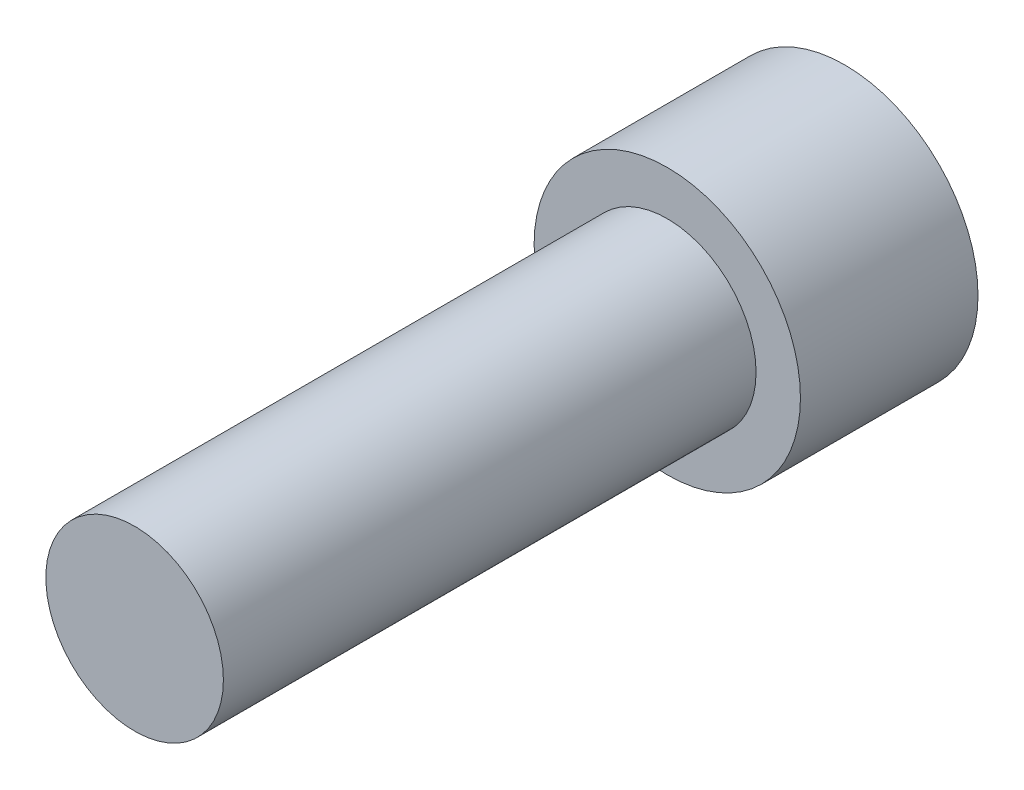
ISO-10303-21;
HEADER;
FILE_DESCRIPTION(('STEP AP214'),'2;1');
FILE_NAME('part.step','',(''),(''),'','','');
FILE_SCHEMA(('AUTOMOTIVE_DESIGN { 1 0 10303 214 1 1 1 1 }'));
ENDSEC;
DATA;
#1=APPLICATION_CONTEXT('core data for automotive mechanical design processes');
#2=APPLICATION_PROTOCOL_DEFINITION('international standard','automotive_design',2000,#1);
#3=PRODUCT_CONTEXT('',#1,'mechanical');
#4=PRODUCT('Part','Part','',(#3));
#5=PRODUCT_RELATED_PRODUCT_CATEGORY('part','',(#4));
#6=PRODUCT_DEFINITION_FORMATION('','',#4);
#7=PRODUCT_DEFINITION_CONTEXT('part definition',#1,'design');
#8=PRODUCT_DEFINITION('design','',#6,#7);
#9=PRODUCT_DEFINITION_SHAPE('','',#8);
#10=(LENGTH_UNIT() NAMED_UNIT(*) SI_UNIT(.MILLI.,.METRE.));
#11=(NAMED_UNIT(*) PLANE_ANGLE_UNIT() SI_UNIT($,.RADIAN.));
#12=(NAMED_UNIT(*) SI_UNIT($,.STERADIAN.) SOLID_ANGLE_UNIT());
#13=UNCERTAINTY_MEASURE_WITH_UNIT(LENGTH_MEASURE(1.E-05),#10,'distance_accuracy_value','');
#14=(GEOMETRIC_REPRESENTATION_CONTEXT(3) GLOBAL_UNCERTAINTY_ASSIGNED_CONTEXT((#13)) GLOBAL_UNIT_ASSIGNED_CONTEXT((#10,
#11,#12)) REPRESENTATION_CONTEXT('',''));
#15=CARTESIAN_POINT('',(0.,0.,0.));
#16=DIRECTION('',(0.,0.,1.));
#17=DIRECTION('',(1.,0.,0.));
#18=AXIS2_PLACEMENT_3D('',#15,#16,#17);
#19=CARTESIAN_POINT('',(0.,-9.525,-12.7));
#20=DIRECTION('',(0.,0.,-1.));
#21=DIRECTION('',(-1.,0.,0.));
#22=AXIS2_PLACEMENT_3D('',#19,#20,#21);
#23=PLANE('',#22);
#24=DIRECTION('',(0.866025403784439,-0.5,0.));
#25=VECTOR('',#24,1.);
#26=CARTESIAN_POINT('',(0.,5.49926131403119,-12.7));
#27=LINE('',#26,#25);
#28=CARTESIAN_POINT('',(0.,5.49926131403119,-12.7));
#29=VERTEX_POINT('',#28);
#30=CARTESIAN_POINT('',(4.7625,2.74963065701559,-12.7));
#31=VERTEX_POINT('',#30);
#32=EDGE_CURVE('E46',#29,#31,#27,.T.);
#33=ORIENTED_EDGE('',*,*,#32,.F.);
#34=DIRECTION('',(0.866025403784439,0.5,0.));
#35=VECTOR('',#34,1.);
#36=CARTESIAN_POINT('',(-4.7625,2.74963065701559,-12.7));
#37=LINE('',#36,#35);
#38=CARTESIAN_POINT('',(-4.7625,2.74963065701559,-12.7));
#39=VERTEX_POINT('',#38);
#40=EDGE_CURVE('E129',#39,#29,#37,.T.);
#41=ORIENTED_EDGE('',*,*,#40,.F.);
#42=DIRECTION('',(0.,1.,0.));
#43=VECTOR('',#42,1.);
#44=CARTESIAN_POINT('',(-4.7625,-2.74963065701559,-12.7));
#45=LINE('',#44,#43);
#46=CARTESIAN_POINT('',(-4.7625,-2.74963065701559,-12.7));
#47=VERTEX_POINT('',#46);
#48=EDGE_CURVE('E127',#47,#39,#45,.T.);
#49=ORIENTED_EDGE('',*,*,#48,.F.);
#50=DIRECTION('',(-0.866025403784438,0.5,0.));
#51=VECTOR('',#50,1.);
#52=CARTESIAN_POINT('',(0.,-5.49926131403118,-12.7));
#53=LINE('',#52,#51);
#54=CARTESIAN_POINT('',(0.,-5.49926131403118,-12.7));
#55=VERTEX_POINT('',#54);
#56=EDGE_CURVE('E94',#55,#47,#53,.T.);
#57=ORIENTED_EDGE('',*,*,#56,.F.);
#58=DIRECTION('',(-0.866025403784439,-0.5,0.));
#59=VECTOR('',#58,1.);
#60=CARTESIAN_POINT('',(4.7625,-2.74963065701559,-12.7));
#61=LINE('',#60,#59);
#62=CARTESIAN_POINT('',(4.7625,-2.74963065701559,-12.7));
#63=VERTEX_POINT('',#62);
#64=EDGE_CURVE('E123',#63,#55,#61,.T.);
#65=ORIENTED_EDGE('',*,*,#64,.F.);
#66=DIRECTION('',(0.,-1.,0.));
#67=VECTOR('',#66,1.);
#68=CARTESIAN_POINT('',(4.7625,2.74963065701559,-12.7));
#69=LINE('',#68,#67);
#70=EDGE_CURVE('E120',#31,#63,#69,.T.);
#71=ORIENTED_EDGE('',*,*,#70,.F.);
#72=EDGE_LOOP('',(#33,#41,#49,#57,#65,#71));
#73=FACE_BOUND('',#72,.T.);
#74=CARTESIAN_POINT('',(0.,0.,-12.7));
#75=DIRECTION('',(0.,0.,1.));
#76=DIRECTION('',(1.,0.,0.));
#77=AXIS2_PLACEMENT_3D('',#74,#75,#76);
#78=CIRCLE('',#77,9.525);
#79=CARTESIAN_POINT('',(9.525,0.,-12.7));
#80=VERTEX_POINT('',#79);
#81=EDGE_CURVE('E11',#80,#80,#78,.T.);
#82=ORIENTED_EDGE('',*,*,#81,.F.);
#83=EDGE_LOOP('',(#82));
#84=FACE_BOUND('',#83,.T.);
#85=ADVANCED_FACE('F32',(#73,#84),#23,.T.);
#86=CARTESIAN_POINT('',(0.,0.,38.1));
#87=DIRECTION('',(0.,0.,1.));
#88=DIRECTION('',(1.,0.,0.));
#89=AXIS2_PLACEMENT_3D('',#86,#87,#88);
#90=CYLINDRICAL_SURFACE('',#89,9.525);
#91=ORIENTED_EDGE('',*,*,#81,.T.);
#92=EDGE_LOOP('',(#91));
#93=FACE_BOUND('',#92,.T.);
#94=CARTESIAN_POINT('',(0.,0.,0.));
#95=DIRECTION('',(0.,0.,1.));
#96=DIRECTION('',(1.,0.,0.));
#97=AXIS2_PLACEMENT_3D('',#94,#95,#96);
#98=CIRCLE('',#97,9.525);
#99=CARTESIAN_POINT('',(9.525,0.,0.));
#100=VERTEX_POINT('',#99);
#101=EDGE_CURVE('E39',#100,#100,#98,.T.);
#102=ORIENTED_EDGE('',*,*,#101,.F.);
#103=EDGE_LOOP('',(#102));
#104=FACE_BOUND('',#103,.T.);
#105=ADVANCED_FACE('F149',(#93,#104),#90,.T.);
#106=CARTESIAN_POINT('',(0.,-6.35,0.));
#107=DIRECTION('',(0.,0.,1.));
#108=DIRECTION('',(1.,0.,0.));
#109=AXIS2_PLACEMENT_3D('',#106,#107,#108);
#110=PLANE('',#109);
#111=ORIENTED_EDGE('',*,*,#101,.T.);
#112=EDGE_LOOP('',(#111));
#113=FACE_BOUND('',#112,.T.);
#114=CARTESIAN_POINT('',(0.,0.,0.));
#115=DIRECTION('',(0.,0.,1.));
#116=DIRECTION('',(1.,0.,0.));
#117=AXIS2_PLACEMENT_3D('',#114,#115,#116);
#118=CIRCLE('',#117,6.35);
#119=CARTESIAN_POINT('',(6.35,0.,0.));
#120=VERTEX_POINT('',#119);
#121=EDGE_CURVE('E141',#120,#120,#118,.T.);
#122=ORIENTED_EDGE('',*,*,#121,.F.);
#123=EDGE_LOOP('',(#122));
#124=FACE_BOUND('',#123,.T.);
#125=ADVANCED_FACE('F146',(#113,#124),#110,.T.);
#126=CARTESIAN_POINT('',(0.,0.,38.1));
#127=DIRECTION('',(0.,0.,1.));
#128=DIRECTION('',(1.,0.,0.));
#129=AXIS2_PLACEMENT_3D('',#126,#127,#128);
#130=CYLINDRICAL_SURFACE('',#129,6.35);
#131=ORIENTED_EDGE('',*,*,#121,.T.);
#132=EDGE_LOOP('',(#131));
#133=FACE_BOUND('',#132,.T.);
#134=CARTESIAN_POINT('',(0.,0.,38.1));
#135=DIRECTION('',(0.,0.,1.));
#136=DIRECTION('',(1.,0.,0.));
#137=AXIS2_PLACEMENT_3D('',#134,#135,#136);
#138=CIRCLE('',#137,6.35);
#139=CARTESIAN_POINT('',(6.35,0.,38.1));
#140=VERTEX_POINT('',#139);
#141=EDGE_CURVE('E133',#140,#140,#138,.T.);
#142=ORIENTED_EDGE('',*,*,#141,.F.);
#143=EDGE_LOOP('',(#142));
#144=FACE_BOUND('',#143,.T.);
#145=ADVANCED_FACE('F156',(#133,#144),#130,.T.);
#146=CARTESIAN_POINT('',(0.,0.,38.1));
#147=DIRECTION('',(0.,0.,1.));
#148=DIRECTION('',(1.,0.,0.));
#149=AXIS2_PLACEMENT_3D('',#146,#147,#148);
#150=PLANE('',#149);
#151=ORIENTED_EDGE('',*,*,#141,.T.);
#152=EDGE_LOOP('',(#151));
#153=FACE_BOUND('',#152,.T.);
#154=ADVANCED_FACE('F162',(#153),#150,.T.);
#155=CARTESIAN_POINT('',(0.,5.49926131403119,-5.588));
#156=DIRECTION('',(0.5,0.866025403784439,0.));
#157=DIRECTION('',(-0.866025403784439,0.5,0.));
#158=AXIS2_PLACEMENT_3D('',#155,#156,#157);
#159=PLANE('',#158);
#160=ORIENTED_EDGE('',*,*,#32,.T.);
#161=DIRECTION('',(0.,0.,-1.));
#162=VECTOR('',#161,1.);
#163=CARTESIAN_POINT('',(4.7625,2.74963065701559,-5.588));
#164=LINE('',#163,#162);
#165=CARTESIAN_POINT('',(4.7625,2.74963065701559,-5.588));
#166=VERTEX_POINT('',#165);
#167=EDGE_CURVE('E76',#166,#31,#164,.T.);
#168=ORIENTED_EDGE('',*,*,#167,.F.);
#169=DIRECTION('',(0.866025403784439,-0.5,0.));
#170=VECTOR('',#169,1.);
#171=CARTESIAN_POINT('',(0.,5.49926131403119,-5.588));
#172=LINE('',#171,#170);
#173=CARTESIAN_POINT('',(0.,5.49926131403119,-5.588));
#174=VERTEX_POINT('',#173);
#175=EDGE_CURVE('E131',#174,#166,#172,.T.);
#176=ORIENTED_EDGE('',*,*,#175,.F.);
#177=DIRECTION('',(0.,0.,-1.));
#178=VECTOR('',#177,1.);
#179=CARTESIAN_POINT('',(0.,5.49926131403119,-5.588));
#180=LINE('',#179,#178);
#181=EDGE_CURVE('E54',#174,#29,#180,.T.);
#182=ORIENTED_EDGE('',*,*,#181,.T.);
#183=EDGE_LOOP('',(#160,#168,#176,#182));
#184=FACE_BOUND('',#183,.T.);
#185=ADVANCED_FACE('F166',(#184),#159,.F.);
#186=CARTESIAN_POINT('',(-4.7625,2.74963065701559,-5.588));
#187=DIRECTION('',(-0.5,0.866025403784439,0.));
#188=DIRECTION('',(-0.866025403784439,-0.5,0.));
#189=AXIS2_PLACEMENT_3D('',#186,#187,#188);
#190=PLANE('',#189);
#191=ORIENTED_EDGE('',*,*,#40,.T.);
#192=ORIENTED_EDGE('',*,*,#181,.F.);
#193=DIRECTION('',(0.866025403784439,0.5,0.));
#194=VECTOR('',#193,1.);
#195=CARTESIAN_POINT('',(-4.7625,2.74963065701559,-5.588));
#196=LINE('',#195,#194);
#197=CARTESIAN_POINT('',(-4.7625,2.74963065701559,-5.588));
#198=VERTEX_POINT('',#197);
#199=EDGE_CURVE('E106',#198,#174,#196,.T.);
#200=ORIENTED_EDGE('',*,*,#199,.F.);
#201=DIRECTION('',(0.,0.,-1.));
#202=VECTOR('',#201,1.);
#203=CARTESIAN_POINT('',(-4.7625,2.74963065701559,-5.588));
#204=LINE('',#203,#202);
#205=EDGE_CURVE('E98',#198,#39,#204,.T.);
#206=ORIENTED_EDGE('',*,*,#205,.T.);
#207=EDGE_LOOP('',(#191,#192,#200,#206));
#208=FACE_BOUND('',#207,.T.);
#209=ADVANCED_FACE('F170',(#208),#190,.F.);
#210=CARTESIAN_POINT('',(-4.7625,-2.74963065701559,-5.588));
#211=DIRECTION('',(-1.,0.,0.));
#212=DIRECTION('',(0.,-1.,0.));
#213=AXIS2_PLACEMENT_3D('',#210,#211,#212);
#214=PLANE('',#213);
#215=ORIENTED_EDGE('',*,*,#48,.T.);
#216=ORIENTED_EDGE('',*,*,#205,.F.);
#217=DIRECTION('',(0.,1.,0.));
#218=VECTOR('',#217,1.);
#219=CARTESIAN_POINT('',(-4.7625,-2.74963065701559,-5.588));
#220=LINE('',#219,#218);
#221=CARTESIAN_POINT('',(-4.7625,-2.74963065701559,-5.588));
#222=VERTEX_POINT('',#221);
#223=EDGE_CURVE('E102',#222,#198,#220,.T.);
#224=ORIENTED_EDGE('',*,*,#223,.F.);
#225=DIRECTION('',(0.,0.,-1.));
#226=VECTOR('',#225,1.);
#227=CARTESIAN_POINT('',(-4.7625,-2.74963065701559,-5.588));
#228=LINE('',#227,#226);
#229=EDGE_CURVE('E87',#222,#47,#228,.T.);
#230=ORIENTED_EDGE('',*,*,#229,.T.);
#231=EDGE_LOOP('',(#215,#216,#224,#230));
#232=FACE_BOUND('',#231,.T.);
#233=ADVANCED_FACE('F103',(#232),#214,.F.);
#234=CARTESIAN_POINT('',(0.,-5.49926131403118,-5.588));
#235=DIRECTION('',(-0.5,-0.866025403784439,0.));
#236=DIRECTION('',(0.866025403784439,-0.5,0.));
#237=AXIS2_PLACEMENT_3D('',#234,#235,#236);
#238=PLANE('',#237);
#239=ORIENTED_EDGE('',*,*,#56,.T.);
#240=ORIENTED_EDGE('',*,*,#229,.F.);
#241=DIRECTION('',(-0.866025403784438,0.5,0.));
#242=VECTOR('',#241,1.);
#243=CARTESIAN_POINT('',(0.,-5.49926131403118,-5.588));
#244=LINE('',#243,#242);
#245=CARTESIAN_POINT('',(0.,-5.49926131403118,-5.588));
#246=VERTEX_POINT('',#245);
#247=EDGE_CURVE('E91',#246,#222,#244,.T.);
#248=ORIENTED_EDGE('',*,*,#247,.F.);
#249=DIRECTION('',(0.,0.,-1.));
#250=VECTOR('',#249,1.);
#251=CARTESIAN_POINT('',(0.,-5.49926131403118,-5.588));
#252=LINE('',#251,#250);
#253=EDGE_CURVE('E99',#246,#55,#252,.T.);
#254=ORIENTED_EDGE('',*,*,#253,.T.);
#255=EDGE_LOOP('',(#239,#240,#248,#254));
#256=FACE_BOUND('',#255,.T.);
#257=ADVANCED_FACE('F89',(#256),#238,.F.);
#258=CARTESIAN_POINT('',(4.7625,-2.74963065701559,-5.588));
#259=DIRECTION('',(0.5,-0.866025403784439,0.));
#260=DIRECTION('',(0.866025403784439,0.5,0.));
#261=AXIS2_PLACEMENT_3D('',#258,#259,#260);
#262=PLANE('',#261);
#263=ORIENTED_EDGE('',*,*,#64,.T.);
#264=ORIENTED_EDGE('',*,*,#253,.F.);
#265=DIRECTION('',(-0.866025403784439,-0.5,0.));
#266=VECTOR('',#265,1.);
#267=CARTESIAN_POINT('',(4.7625,-2.74963065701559,-5.588));
#268=LINE('',#267,#266);
#269=CARTESIAN_POINT('',(4.7625,-2.74963065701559,-5.588));
#270=VERTEX_POINT('',#269);
#271=EDGE_CURVE('E112',#270,#246,#268,.T.);
#272=ORIENTED_EDGE('',*,*,#271,.F.);
#273=DIRECTION('',(0.,0.,-1.));
#274=VECTOR('',#273,1.);
#275=CARTESIAN_POINT('',(4.7625,-2.74963065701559,-5.588));
#276=LINE('',#275,#274);
#277=EDGE_CURVE('E136',#270,#63,#276,.T.);
#278=ORIENTED_EDGE('',*,*,#277,.T.);
#279=EDGE_LOOP('',(#263,#264,#272,#278));
#280=FACE_BOUND('',#279,.T.);
#281=ADVANCED_FACE('F174',(#280),#262,.F.);
#282=CARTESIAN_POINT('',(4.7625,2.74963065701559,-5.588));
#283=DIRECTION('',(1.,0.,0.));
#284=DIRECTION('',(0.,0.,-1.));
#285=AXIS2_PLACEMENT_3D('',#282,#283,#284);
#286=PLANE('',#285);
#287=ORIENTED_EDGE('',*,*,#70,.T.);
#288=ORIENTED_EDGE('',*,*,#277,.F.);
#289=DIRECTION('',(0.,-1.,0.));
#290=VECTOR('',#289,1.);
#291=CARTESIAN_POINT('',(4.7625,2.74963065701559,-5.588));
#292=LINE('',#291,#290);
#293=EDGE_CURVE('E114',#166,#270,#292,.T.);
#294=ORIENTED_EDGE('',*,*,#293,.F.);
#295=ORIENTED_EDGE('',*,*,#167,.T.);
#296=EDGE_LOOP('',(#287,#288,#294,#295));
#297=FACE_BOUND('',#296,.T.);
#298=ADVANCED_FACE('F171',(#297),#286,.F.);
#299=CARTESIAN_POINT('',(9.525,0.,-5.588));
#300=DIRECTION('',(0.,0.,-1.));
#301=DIRECTION('',(-1.,0.,0.));
#302=AXIS2_PLACEMENT_3D('',#299,#300,#301);
#303=PLANE('',#302);
#304=ORIENTED_EDGE('',*,*,#175,.T.);
#305=ORIENTED_EDGE('',*,*,#293,.T.);
#306=ORIENTED_EDGE('',*,*,#271,.T.);
#307=ORIENTED_EDGE('',*,*,#247,.T.);
#308=ORIENTED_EDGE('',*,*,#223,.T.);
#309=ORIENTED_EDGE('',*,*,#199,.T.);
#310=EDGE_LOOP('',(#304,#305,#306,#307,#308,#309));
#311=FACE_BOUND('',#310,.T.);
#312=ADVANCED_FACE('F109',(#311),#303,.T.);
#313=CLOSED_SHELL('',(#85,#105,#125,#145,#154,#185,#209,#233,#257,#281,#298,#312));
#314=MANIFOLD_SOLID_BREP('B2',#313);
#315=ADVANCED_BREP_SHAPE_REPRESENTATION('',(#18,#314),#14);
#316=SHAPE_DEFINITION_REPRESENTATION(#9,#315);
ENDSEC;
END-ISO-10303-21;
